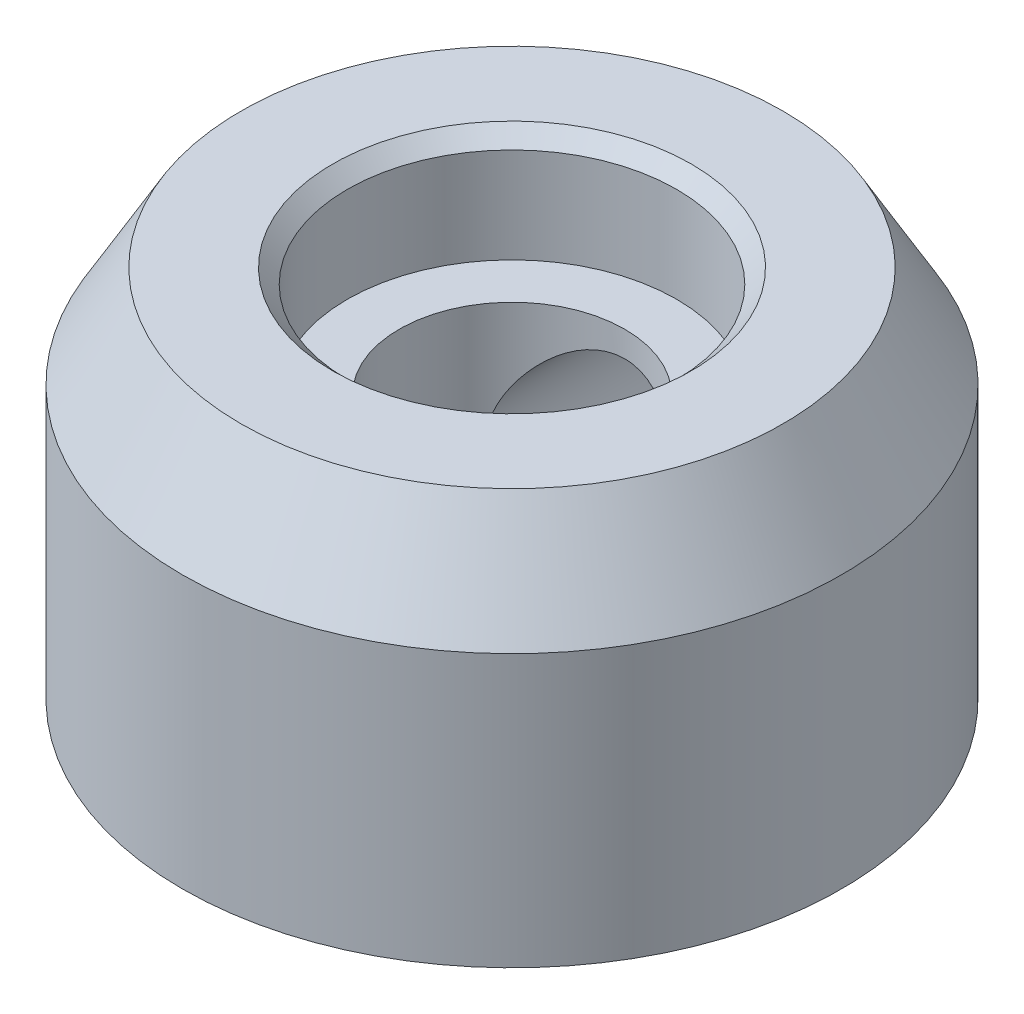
from build123d import *

# Parameters (mm, degrees)
SKETCH3_R          = 3.96875
CUT_EXTRUDE1_DEPTH = 27.705883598
CHAMFER1_SIZE      = 0.635
CHAMFER2_SIZE      = 2.54
CHAMFER2_SIZE2     = 4.399409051


with BuildPart() as part:
    # Sketch2 → Revolve1 (revolve)
    with BuildSketch(Plane.XY, mode=Mode.PRIVATE) as revolve1_sk:
        Polygon((14.2875, 17.4625), (7.1374, 17.4625), (7.1374, 12.7), (4.8895, 12.7), (4.8895, 0), (6.2103, 0), (6.2103, 1.27), (8.3947, 1.27), (8.3947, 0), (11.1633, 0), (11.1633, 1.27), (14.2875, 1.27), align=None)
    revolve(revolve1_sk.sketch.rotate(Axis((0, 0, 0), (0, 1, 0)), 90), axis=Axis((0, 0, 0), (0, 1, 0)))

    # Sketch3 → Cut-Extrude1 (cut, through all)
    with BuildSketch(Plane.XY):
        with Locations(Location((0, 7.62, 0), (0, 0, 270.000000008))):
            Circle(SKETCH3_R)
    extrude(amount=-CUT_EXTRUDE1_DEPTH, mode=Mode.SUBTRACT)

    # Chamfer1
    chamfer1_edges = [part.edges().sort_by_distance(p)[0] for p in [
        (0, 17.4625, 7.1374),
    ]]
    chamfer(chamfer1_edges, length=CHAMFER1_SIZE)

    # Chamfer2
    chamfer2_edges = [part.edges().sort_by_distance(p)[0] for p in [
        (0, 17.4625, 14.2875),
    ]]
    chamfer2_side = [part.faces().sort_by_distance(p)[0] for p in [
        (0, 17.4625, 8.176511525),
    ]]
    chamfer(chamfer2_edges, length=CHAMFER2_SIZE, length2=CHAMFER2_SIZE2, reference=chamfer2_side[0])


solid = part.part
